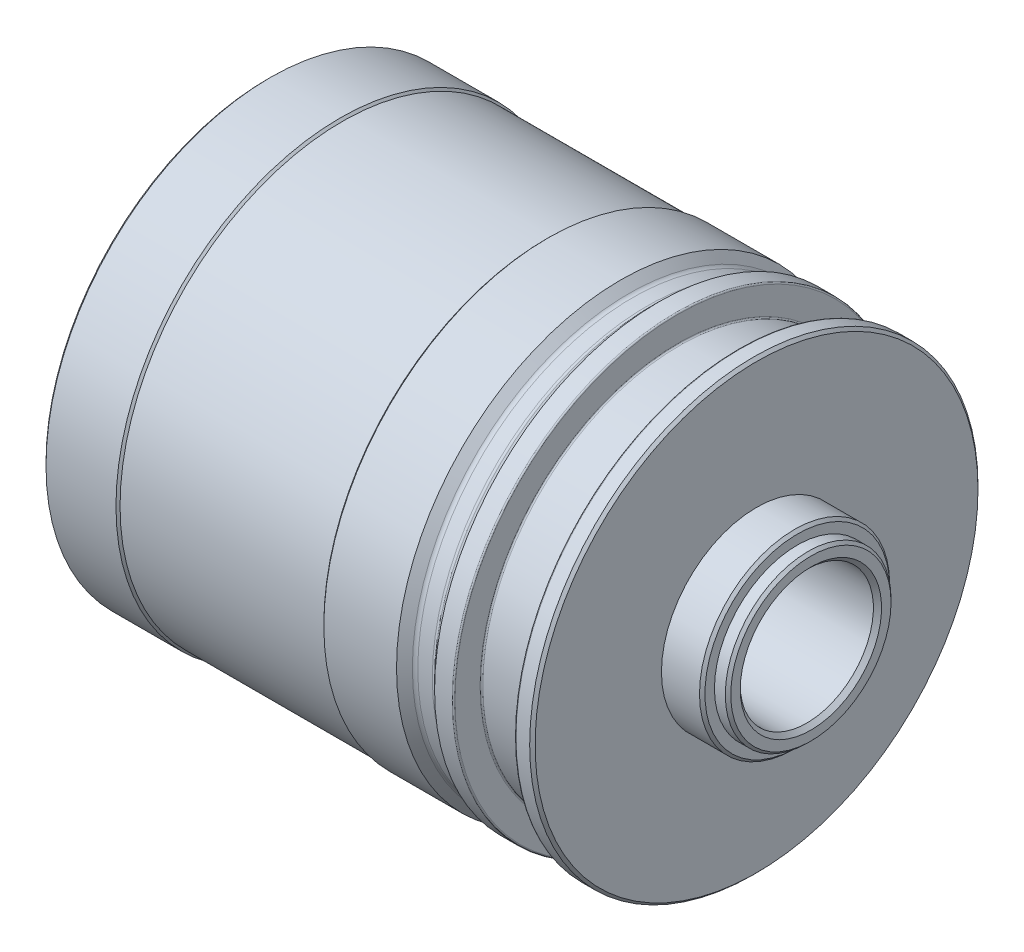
ISO-10303-21;
HEADER;
FILE_DESCRIPTION(('STEP AP214'),'2;1');
FILE_NAME('part.step','',(''),(''),'','','');
FILE_SCHEMA(('AUTOMOTIVE_DESIGN { 1 0 10303 214 1 1 1 1 }'));
ENDSEC;
DATA;
#1=APPLICATION_CONTEXT('core data for automotive mechanical design processes');
#2=APPLICATION_PROTOCOL_DEFINITION('international standard','automotive_design',2000,#1);
#3=PRODUCT_CONTEXT('',#1,'mechanical');
#4=PRODUCT('Part','Part','',(#3));
#5=PRODUCT_RELATED_PRODUCT_CATEGORY('part','',(#4));
#6=PRODUCT_DEFINITION_FORMATION('','',#4);
#7=PRODUCT_DEFINITION_CONTEXT('part definition',#1,'design');
#8=PRODUCT_DEFINITION('design','',#6,#7);
#9=PRODUCT_DEFINITION_SHAPE('','',#8);
#10=(LENGTH_UNIT() NAMED_UNIT(*) SI_UNIT(.MILLI.,.METRE.));
#11=(NAMED_UNIT(*) PLANE_ANGLE_UNIT() SI_UNIT($,.RADIAN.));
#12=(NAMED_UNIT(*) SI_UNIT($,.STERADIAN.) SOLID_ANGLE_UNIT());
#13=UNCERTAINTY_MEASURE_WITH_UNIT(LENGTH_MEASURE(1.E-05),#10,'distance_accuracy_value','');
#14=(GEOMETRIC_REPRESENTATION_CONTEXT(3) GLOBAL_UNCERTAINTY_ASSIGNED_CONTEXT((#13)) GLOBAL_UNIT_ASSIGNED_CONTEXT((#10,
#11,#12)) REPRESENTATION_CONTEXT('',''));
#15=CARTESIAN_POINT('',(0.,0.,0.));
#16=DIRECTION('',(0.,0.,1.));
#17=DIRECTION('',(1.,0.,0.));
#18=AXIS2_PLACEMENT_3D('',#15,#16,#17);
#19=CARTESIAN_POINT('',(8.00000000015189,0.,0.));
#20=DIRECTION('',(-1.,0.,0.));
#21=DIRECTION('',(0.,0.,1.));
#22=AXIS2_PLACEMENT_3D('',#19,#20,#21);
#23=CYLINDRICAL_SURFACE('',#22,16.5);
#24=CARTESIAN_POINT('',(-14.,0.,0.));
#25=DIRECTION('',(-1.,0.,0.));
#26=DIRECTION('',(0.,0.,1.));
#27=AXIS2_PLACEMENT_3D('',#24,#25,#26);
#28=CIRCLE('',#27,16.5);
#29=CARTESIAN_POINT('',(-14.,0.,16.5));
#30=VERTEX_POINT('',#29);
#31=EDGE_CURVE('E133',#30,#30,#28,.T.);
#32=ORIENTED_EDGE('',*,*,#31,.T.);
#33=EDGE_LOOP('',(#32));
#34=FACE_BOUND('',#33,.T.);
#35=CARTESIAN_POINT('',(-19.35,0.,0.));
#36=DIRECTION('',(-1.,0.,0.));
#37=DIRECTION('',(0.,0.,1.));
#38=AXIS2_PLACEMENT_3D('',#35,#36,#37);
#39=CIRCLE('',#38,16.5);
#40=CARTESIAN_POINT('',(-19.35,0.,16.5));
#41=VERTEX_POINT('',#40);
#42=EDGE_CURVE('E136',#41,#41,#39,.T.);
#43=ORIENTED_EDGE('',*,*,#42,.F.);
#44=EDGE_LOOP('',(#43));
#45=FACE_BOUND('',#44,.T.);
#46=ADVANCED_FACE('F29',(#34,#45),#23,.T.);
#47=CARTESIAN_POINT('',(-39.8,0.,0.));
#48=DIRECTION('',(-1.,0.,0.));
#49=DIRECTION('',(0.,0.,1.));
#50=AXIS2_PLACEMENT_3D('',#47,#48,#49);
#51=CIRCLE('',#50,16.5);
#52=CARTESIAN_POINT('',(-39.8,0.,16.5));
#53=VERTEX_POINT('',#52);
#54=EDGE_CURVE('E73',#53,#53,#51,.F.);
#55=ORIENTED_EDGE('',*,*,#54,.T.);
#56=EDGE_LOOP('',(#55));
#57=FACE_BOUND('',#56,.T.);
#58=CARTESIAN_POINT('',(-34.65,0.,0.));
#59=DIRECTION('',(-1.,0.,0.));
#60=DIRECTION('',(0.,0.,1.));
#61=AXIS2_PLACEMENT_3D('',#58,#59,#60);
#62=CIRCLE('',#61,16.5);
#63=CARTESIAN_POINT('',(-34.65,0.,16.5));
#64=VERTEX_POINT('',#63);
#65=EDGE_CURVE('E145',#64,#64,#62,.T.);
#66=ORIENTED_EDGE('',*,*,#65,.T.);
#67=EDGE_LOOP('',(#66));
#68=FACE_BOUND('',#67,.T.);
#69=ADVANCED_FACE('F149',(#57,#68),#23,.T.);
#70=CARTESIAN_POINT('',(-9.89999999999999,0.,0.));
#71=DIRECTION('',(1.,0.,0.));
#72=DIRECTION('',(0.,0.,-1.));
#73=AXIS2_PLACEMENT_3D('',#70,#71,#72);
#74=CIRCLE('',#73,16.5);
#75=CARTESIAN_POINT('',(-9.89999999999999,0.,-16.5));
#76=VERTEX_POINT('',#75);
#77=EDGE_CURVE('E52',#76,#76,#74,.F.);
#78=ORIENTED_EDGE('',*,*,#77,.T.);
#79=EDGE_LOOP('',(#78));
#80=FACE_BOUND('',#79,.T.);
#81=CARTESIAN_POINT('',(-11.2,0.,0.));
#82=DIRECTION('',(-1.,0.,0.));
#83=DIRECTION('',(0.,0.,1.));
#84=AXIS2_PLACEMENT_3D('',#81,#82,#83);
#85=CIRCLE('',#84,16.5);
#86=CARTESIAN_POINT('',(-11.2,0.,16.5));
#87=VERTEX_POINT('',#86);
#88=EDGE_CURVE('E130',#87,#87,#85,.T.);
#89=ORIENTED_EDGE('',*,*,#88,.F.);
#90=EDGE_LOOP('',(#89));
#91=FACE_BOUND('',#90,.T.);
#92=ADVANCED_FACE('F165',(#80,#91),#23,.T.);
#93=CARTESIAN_POINT('',(-21.3,4.,0.));
#94=DIRECTION('',(-1.,0.,0.));
#95=DIRECTION('',(0.,0.,1.));
#96=AXIS2_PLACEMENT_3D('',#93,#94,#95);
#97=PLANE('',#96);
#98=CARTESIAN_POINT('',(-21.3,0.,0.));
#99=DIRECTION('',(-1.,0.,0.));
#100=DIRECTION('',(0.,0.,1.));
#101=AXIS2_PLACEMENT_3D('',#98,#99,#100);
#102=CIRCLE('',#101,4.2);
#103=CARTESIAN_POINT('',(-21.3,0.,4.2));
#104=VERTEX_POINT('',#103);
#105=EDGE_CURVE('E85',#104,#104,#102,.F.);
#106=ORIENTED_EDGE('',*,*,#105,.T.);
#107=EDGE_LOOP('',(#106));
#108=FACE_BOUND('',#107,.T.);
#109=CARTESIAN_POINT('',(-21.3,0.,0.));
#110=DIRECTION('',(-1.,0.,0.));
#111=DIRECTION('',(0.,0.,1.));
#112=AXIS2_PLACEMENT_3D('',#109,#110,#111);
#113=CIRCLE('',#112,15.);
#114=CARTESIAN_POINT('',(-21.3,0.,15.));
#115=VERTEX_POINT('',#114);
#116=EDGE_CURVE('E127',#115,#115,#113,.T.);
#117=ORIENTED_EDGE('',*,*,#116,.T.);
#118=EDGE_LOOP('',(#117));
#119=FACE_BOUND('',#118,.T.);
#120=ADVANCED_FACE('F174',(#108,#119),#97,.T.);
#121=CARTESIAN_POINT('',(8.00000000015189,0.,0.));
#122=DIRECTION('',(-1.,0.,0.));
#123=DIRECTION('',(0.,0.,1.));
#124=AXIS2_PLACEMENT_3D('',#121,#122,#123);
#125=CYLINDRICAL_SURFACE('',#124,4.);
#126=CARTESIAN_POINT('',(-21.1,0.,0.));
#127=DIRECTION('',(-1.,0.,0.));
#128=DIRECTION('',(0.,0.,1.));
#129=AXIS2_PLACEMENT_3D('',#126,#127,#128);
#130=CIRCLE('',#129,4.);
#131=CARTESIAN_POINT('',(-21.1,0.,4.));
#132=VERTEX_POINT('',#131);
#133=EDGE_CURVE('E88',#132,#132,#130,.T.);
#134=ORIENTED_EDGE('',*,*,#133,.T.);
#135=EDGE_LOOP('',(#134));
#136=FACE_BOUND('',#135,.T.);
#137=CARTESIAN_POINT('',(-11.3,0.,0.));
#138=DIRECTION('',(-1.,0.,0.));
#139=DIRECTION('',(0.,0.,1.));
#140=AXIS2_PLACEMENT_3D('',#137,#138,#139);
#141=CIRCLE('',#140,4.);
#142=CARTESIAN_POINT('',(-11.3,0.,4.));
#143=VERTEX_POINT('',#142);
#144=EDGE_CURVE('E97',#143,#143,#141,.T.);
#145=ORIENTED_EDGE('',*,*,#144,.F.);
#146=EDGE_LOOP('',(#145));
#147=FACE_BOUND('',#146,.T.);
#148=ADVANCED_FACE('F179',(#136,#147),#125,.F.);
#149=CARTESIAN_POINT('',(-11.3,4.9,0.));
#150=DIRECTION('',(1.,0.,0.));
#151=DIRECTION('',(0.,0.,-1.));
#152=AXIS2_PLACEMENT_3D('',#149,#150,#151);
#153=PLANE('',#152);
#154=ORIENTED_EDGE('',*,*,#144,.T.);
#155=EDGE_LOOP('',(#154));
#156=FACE_BOUND('',#155,.T.);
#157=CARTESIAN_POINT('',(-11.3,0.,0.));
#158=DIRECTION('',(-1.,0.,0.));
#159=DIRECTION('',(0.,0.,1.));
#160=AXIS2_PLACEMENT_3D('',#157,#158,#159);
#161=CIRCLE('',#160,4.9);
#162=CARTESIAN_POINT('',(-11.3,0.,4.9));
#163=VERTEX_POINT('',#162);
#164=EDGE_CURVE('E100',#163,#163,#161,.T.);
#165=ORIENTED_EDGE('',*,*,#164,.F.);
#166=EDGE_LOOP('',(#165));
#167=FACE_BOUND('',#166,.T.);
#168=ADVANCED_FACE('F310',(#156,#167),#153,.T.);
#169=CARTESIAN_POINT('',(8.00000000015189,0.,0.));
#170=DIRECTION('',(-1.,0.,0.));
#171=DIRECTION('',(0.,0.,1.));
#172=AXIS2_PLACEMENT_3D('',#169,#170,#171);
#173=CYLINDRICAL_SURFACE('',#172,4.9);
#174=ORIENTED_EDGE('',*,*,#164,.T.);
#175=EDGE_LOOP('',(#174));
#176=FACE_BOUND('',#175,.T.);
#177=CARTESIAN_POINT('',(-0.3,0.,0.));
#178=DIRECTION('',(-1.,0.,0.));
#179=DIRECTION('',(0.,0.,1.));
#180=AXIS2_PLACEMENT_3D('',#177,#178,#179);
#181=CIRCLE('',#180,4.9);
#182=CARTESIAN_POINT('',(-0.3,0.,4.9));
#183=VERTEX_POINT('',#182);
#184=EDGE_CURVE('E103',#183,#183,#181,.T.);
#185=ORIENTED_EDGE('',*,*,#184,.F.);
#186=EDGE_LOOP('',(#185));
#187=FACE_BOUND('',#186,.T.);
#188=ADVANCED_FACE('F306',(#176,#187),#173,.F.);
#189=CARTESIAN_POINT('',(0.,0.,0.));
#190=DIRECTION('',(1.,0.,0.));
#191=DIRECTION('',(0.,0.,-1.));
#192=AXIS2_PLACEMENT_3D('',#189,#190,#191);
#193=CONICAL_SURFACE('',#192,5.20000000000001,0.785398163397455);
#194=ORIENTED_EDGE('',*,*,#184,.T.);
#195=EDGE_LOOP('',(#194));
#196=FACE_BOUND('',#195,.T.);
#197=CARTESIAN_POINT('',(0.,0.,0.));
#198=DIRECTION('',(-1.,0.,0.));
#199=DIRECTION('',(0.,0.,1.));
#200=AXIS2_PLACEMENT_3D('',#197,#198,#199);
#201=CIRCLE('',#200,5.20000000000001);
#202=CARTESIAN_POINT('',(0.,0.,5.20000000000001));
#203=VERTEX_POINT('',#202);
#204=EDGE_CURVE('E106',#203,#203,#201,.T.);
#205=ORIENTED_EDGE('',*,*,#204,.F.);
#206=EDGE_LOOP('',(#205));
#207=FACE_BOUND('',#206,.T.);
#208=ADVANCED_FACE('F302',(#196,#207),#193,.F.);
#209=CARTESIAN_POINT('',(0.,6.1,0.));
#210=DIRECTION('',(1.,0.,0.));
#211=DIRECTION('',(0.,0.,-1.));
#212=AXIS2_PLACEMENT_3D('',#209,#210,#211);
#213=PLANE('',#212);
#214=CARTESIAN_POINT('',(0.,0.,0.));
#215=DIRECTION('',(1.,0.,0.));
#216=DIRECTION('',(0.,0.,-1.));
#217=AXIS2_PLACEMENT_3D('',#214,#215,#216);
#218=CIRCLE('',#217,5.9);
#219=CARTESIAN_POINT('',(0.,0.,-5.9));
#220=VERTEX_POINT('',#219);
#221=EDGE_CURVE('E91',#220,#220,#218,.T.);
#222=ORIENTED_EDGE('',*,*,#221,.T.);
#223=EDGE_LOOP('',(#222));
#224=FACE_BOUND('',#223,.T.);
#225=ORIENTED_EDGE('',*,*,#204,.T.);
#226=EDGE_LOOP('',(#225));
#227=FACE_BOUND('',#226,.T.);
#228=ADVANCED_FACE('F298',(#224,#227),#213,.T.);
#229=CARTESIAN_POINT('',(8.00000000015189,0.,0.));
#230=DIRECTION('',(-1.,0.,0.));
#231=DIRECTION('',(0.,0.,1.));
#232=AXIS2_PLACEMENT_3D('',#229,#230,#231);
#233=CYLINDRICAL_SURFACE('',#232,6.1);
#234=CARTESIAN_POINT('',(-0.200000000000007,0.,0.));
#235=DIRECTION('',(1.,0.,0.));
#236=DIRECTION('',(0.,0.,-1.));
#237=AXIS2_PLACEMENT_3D('',#234,#235,#236);
#238=CIRCLE('',#237,6.1);
#239=CARTESIAN_POINT('',(-0.200000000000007,0.,-6.1));
#240=VERTEX_POINT('',#239);
#241=EDGE_CURVE('E94',#240,#240,#238,.F.);
#242=ORIENTED_EDGE('',*,*,#241,.T.);
#243=EDGE_LOOP('',(#242));
#244=FACE_BOUND('',#243,.T.);
#245=CARTESIAN_POINT('',(-0.999999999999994,0.,0.));
#246=DIRECTION('',(-1.,0.,0.));
#247=DIRECTION('',(0.,0.,1.));
#248=AXIS2_PLACEMENT_3D('',#245,#246,#247);
#249=CIRCLE('',#248,6.1);
#250=CARTESIAN_POINT('',(-0.999999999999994,0.,6.1));
#251=VERTEX_POINT('',#250);
#252=EDGE_CURVE('E109',#251,#251,#249,.T.);
#253=ORIENTED_EDGE('',*,*,#252,.F.);
#254=EDGE_LOOP('',(#253));
#255=FACE_BOUND('',#254,.T.);
#256=ADVANCED_FACE('F294',(#244,#255),#233,.T.);
#257=CARTESIAN_POINT('',(-0.999999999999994,7.,0.));
#258=DIRECTION('',(1.,0.,0.));
#259=DIRECTION('',(0.,0.,-1.));
#260=AXIS2_PLACEMENT_3D('',#257,#258,#259);
#261=PLANE('',#260);
#262=CARTESIAN_POINT('',(-0.999999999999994,0.,0.));
#263=DIRECTION('',(1.,0.,0.));
#264=DIRECTION('',(0.,0.,-1.));
#265=AXIS2_PLACEMENT_3D('',#262,#263,#264);
#266=CIRCLE('',#265,6.8);
#267=CARTESIAN_POINT('',(-0.999999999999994,0.,-6.8));
#268=VERTEX_POINT('',#267);
#269=EDGE_CURVE('E67',#268,#268,#266,.T.);
#270=ORIENTED_EDGE('',*,*,#269,.T.);
#271=EDGE_LOOP('',(#270));
#272=FACE_BOUND('',#271,.T.);
#273=ORIENTED_EDGE('',*,*,#252,.T.);
#274=EDGE_LOOP('',(#273));
#275=FACE_BOUND('',#274,.T.);
#276=ADVANCED_FACE('F290',(#272,#275),#261,.T.);
#277=CARTESIAN_POINT('',(8.00000000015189,0.,0.));
#278=DIRECTION('',(-1.,0.,0.));
#279=DIRECTION('',(0.,0.,1.));
#280=AXIS2_PLACEMENT_3D('',#277,#278,#279);
#281=CYLINDRICAL_SURFACE('',#280,7.);
#282=CARTESIAN_POINT('',(-1.2,0.,0.));
#283=DIRECTION('',(1.,0.,0.));
#284=DIRECTION('',(0.,0.,-1.));
#285=AXIS2_PLACEMENT_3D('',#282,#283,#284);
#286=CIRCLE('',#285,7.);
#287=CARTESIAN_POINT('',(-1.2,0.,-7.));
#288=VERTEX_POINT('',#287);
#289=EDGE_CURVE('E70',#288,#288,#286,.F.);
#290=ORIENTED_EDGE('',*,*,#289,.T.);
#291=EDGE_LOOP('',(#290));
#292=FACE_BOUND('',#291,.T.);
#293=CARTESIAN_POINT('',(-4.,0.,0.));
#294=DIRECTION('',(-1.,0.,0.));
#295=DIRECTION('',(0.,0.,1.));
#296=AXIS2_PLACEMENT_3D('',#293,#294,#295);
#297=CIRCLE('',#296,7.);
#298=CARTESIAN_POINT('',(-4.,0.,7.));
#299=VERTEX_POINT('',#298);
#300=EDGE_CURVE('E112',#299,#299,#297,.T.);
#301=ORIENTED_EDGE('',*,*,#300,.F.);
#302=EDGE_LOOP('',(#301));
#303=FACE_BOUND('',#302,.T.);
#304=ADVANCED_FACE('F287',(#292,#303),#281,.T.);
#305=CARTESIAN_POINT('',(-3.99999999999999,16.5,0.));
#306=DIRECTION('',(1.,0.,0.));
#307=DIRECTION('',(0.,0.,-1.));
#308=AXIS2_PLACEMENT_3D('',#305,#306,#307);
#309=PLANE('',#308);
#310=CARTESIAN_POINT('',(-3.99999999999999,0.,0.));
#311=DIRECTION('',(1.,0.,0.));
#312=DIRECTION('',(0.,0.,-1.));
#313=AXIS2_PLACEMENT_3D('',#310,#311,#312);
#314=CIRCLE('',#313,16.3);
#315=CARTESIAN_POINT('',(-3.99999999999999,0.,-16.3));
#316=VERTEX_POINT('',#315);
#317=EDGE_CURVE('E10',#316,#316,#314,.T.);
#318=ORIENTED_EDGE('',*,*,#317,.T.);
#319=EDGE_LOOP('',(#318));
#320=FACE_BOUND('',#319,.T.);
#321=ORIENTED_EDGE('',*,*,#300,.T.);
#322=EDGE_LOOP('',(#321));
#323=FACE_BOUND('',#322,.T.);
#324=ADVANCED_FACE('F284',(#320,#323),#309,.T.);
#325=CARTESIAN_POINT('',(8.00000000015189,0.,0.));
#326=DIRECTION('',(-1.,0.,0.));
#327=DIRECTION('',(0.,0.,1.));
#328=AXIS2_PLACEMENT_3D('',#325,#326,#327);
#329=CYLINDRICAL_SURFACE('',#328,16.5);
#330=CARTESIAN_POINT('',(-4.19999999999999,0.,0.));
#331=DIRECTION('',(1.,0.,0.));
#332=DIRECTION('',(0.,0.,-1.));
#333=AXIS2_PLACEMENT_3D('',#330,#331,#332);
#334=CIRCLE('',#333,16.5);
#335=CARTESIAN_POINT('',(-4.19999999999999,0.,-16.5));
#336=VERTEX_POINT('',#335);
#337=EDGE_CURVE('E36',#336,#336,#334,.F.);
#338=ORIENTED_EDGE('',*,*,#337,.T.);
#339=EDGE_LOOP('',(#338));
#340=FACE_BOUND('',#339,.T.);
#341=CARTESIAN_POINT('',(-5.19999999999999,0.,0.));
#342=DIRECTION('',(-1.,0.,0.));
#343=DIRECTION('',(0.,0.,1.));
#344=AXIS2_PLACEMENT_3D('',#341,#342,#343);
#345=CIRCLE('',#344,16.5);
#346=CARTESIAN_POINT('',(-5.19999999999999,0.,16.5));
#347=VERTEX_POINT('',#346);
#348=EDGE_CURVE('E40',#347,#347,#345,.F.);
#349=ORIENTED_EDGE('',*,*,#348,.T.);
#350=EDGE_LOOP('',(#349));
#351=FACE_BOUND('',#350,.T.);
#352=ADVANCED_FACE('F259',(#340,#351),#329,.T.);
#353=CARTESIAN_POINT('',(-5.29999999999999,14.85,0.));
#354=DIRECTION('',(-1.,0.,0.));
#355=DIRECTION('',(0.,0.,1.));
#356=AXIS2_PLACEMENT_3D('',#353,#354,#355);
#357=PLANE('',#356);
#358=CARTESIAN_POINT('',(-5.29999999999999,0.,0.));
#359=DIRECTION('',(-1.,0.,0.));
#360=DIRECTION('',(0.,0.,1.));
#361=AXIS2_PLACEMENT_3D('',#358,#359,#360);
#362=CIRCLE('',#361,16.4);
#363=CARTESIAN_POINT('',(-5.29999999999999,0.,16.4));
#364=VERTEX_POINT('',#363);
#365=EDGE_CURVE('E44',#364,#364,#362,.T.);
#366=ORIENTED_EDGE('',*,*,#365,.T.);
#367=EDGE_LOOP('',(#366));
#368=FACE_BOUND('',#367,.T.);
#369=CARTESIAN_POINT('',(-5.3,0.,0.));
#370=DIRECTION('',(-1.,0.,0.));
#371=DIRECTION('',(0.,0.,1.));
#372=AXIS2_PLACEMENT_3D('',#369,#370,#371);
#373=CIRCLE('',#372,14.85);
#374=CARTESIAN_POINT('',(-5.3,0.,14.85));
#375=VERTEX_POINT('',#374);
#376=EDGE_CURVE('E115',#375,#375,#373,.T.);
#377=ORIENTED_EDGE('',*,*,#376,.F.);
#378=EDGE_LOOP('',(#377));
#379=FACE_BOUND('',#378,.T.);
#380=ADVANCED_FACE('F255',(#368,#379),#357,.T.);
#381=CARTESIAN_POINT('',(-5.69999999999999,0.,0.));
#382=DIRECTION('',(-1.,0.,0.));
#383=DIRECTION('',(0.,0.,1.));
#384=AXIS2_PLACEMENT_3D('',#381,#382,#383);
#385=TOROIDAL_SURFACE('',#384,14.85,0.399999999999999);
#386=ORIENTED_EDGE('',*,*,#376,.T.);
#387=EDGE_LOOP('',(#386));
#388=FACE_BOUND('',#387,.T.);
#389=CARTESIAN_POINT('',(-5.69999999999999,0.,0.));
#390=DIRECTION('',(-1.,0.,0.));
#391=DIRECTION('',(0.,0.,1.));
#392=AXIS2_PLACEMENT_3D('',#389,#390,#391);
#393=CIRCLE('',#392,14.45);
#394=CARTESIAN_POINT('',(-5.69999999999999,0.,14.45));
#395=VERTEX_POINT('',#394);
#396=EDGE_CURVE('E118',#395,#395,#393,.T.);
#397=ORIENTED_EDGE('',*,*,#396,.F.);
#398=EDGE_LOOP('',(#397));
#399=FACE_BOUND('',#398,.T.);
#400=ADVANCED_FACE('F258',(#388,#399),#385,.F.);
#401=CARTESIAN_POINT('',(8.00000000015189,0.,0.));
#402=DIRECTION('',(-1.,0.,0.));
#403=DIRECTION('',(0.,0.,1.));
#404=AXIS2_PLACEMENT_3D('',#401,#402,#403);
#405=CYLINDRICAL_SURFACE('',#404,14.45);
#406=ORIENTED_EDGE('',*,*,#396,.T.);
#407=EDGE_LOOP('',(#406));
#408=FACE_BOUND('',#407,.T.);
#409=CARTESIAN_POINT('',(-9.69999999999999,0.,0.));
#410=DIRECTION('',(-1.,0.,0.));
#411=DIRECTION('',(0.,0.,1.));
#412=AXIS2_PLACEMENT_3D('',#409,#410,#411);
#413=CIRCLE('',#412,14.45);
#414=CARTESIAN_POINT('',(-9.69999999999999,0.,14.45));
#415=VERTEX_POINT('',#414);
#416=EDGE_CURVE('E121',#415,#415,#413,.T.);
#417=ORIENTED_EDGE('',*,*,#416,.F.);
#418=EDGE_LOOP('',(#417));
#419=FACE_BOUND('',#418,.T.);
#420=ADVANCED_FACE('F265',(#408,#419),#405,.T.);
#421=CARTESIAN_POINT('',(-9.69999999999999,0.,0.));
#422=DIRECTION('',(-1.,0.,0.));
#423=DIRECTION('',(0.,0.,1.));
#424=AXIS2_PLACEMENT_3D('',#421,#422,#423);
#425=TOROIDAL_SURFACE('',#424,14.55,0.0999999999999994);
#426=ORIENTED_EDGE('',*,*,#416,.T.);
#427=EDGE_LOOP('',(#426));
#428=FACE_BOUND('',#427,.T.);
#429=CARTESIAN_POINT('',(-9.79999999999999,0.,0.));
#430=DIRECTION('',(-1.,0.,0.));
#431=DIRECTION('',(0.,0.,1.));
#432=AXIS2_PLACEMENT_3D('',#429,#430,#431);
#433=CIRCLE('',#432,14.55);
#434=CARTESIAN_POINT('',(-9.79999999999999,0.,14.55));
#435=VERTEX_POINT('',#434);
#436=EDGE_CURVE('E124',#435,#435,#433,.T.);
#437=ORIENTED_EDGE('',*,*,#436,.F.);
#438=EDGE_LOOP('',(#437));
#439=FACE_BOUND('',#438,.T.);
#440=ADVANCED_FACE('F209',(#428,#439),#425,.F.);
#441=CARTESIAN_POINT('',(-9.79999999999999,16.5,0.));
#442=DIRECTION('',(1.,0.,0.));
#443=DIRECTION('',(0.,0.,-1.));
#444=AXIS2_PLACEMENT_3D('',#441,#442,#443);
#445=PLANE('',#444);
#446=CARTESIAN_POINT('',(-9.79999999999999,0.,0.));
#447=DIRECTION('',(1.,0.,0.));
#448=DIRECTION('',(0.,0.,-1.));
#449=AXIS2_PLACEMENT_3D('',#446,#447,#448);
#450=CIRCLE('',#449,16.4);
#451=CARTESIAN_POINT('',(-9.79999999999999,0.,-16.4));
#452=VERTEX_POINT('',#451);
#453=EDGE_CURVE('E49',#452,#452,#450,.T.);
#454=ORIENTED_EDGE('',*,*,#453,.T.);
#455=EDGE_LOOP('',(#454));
#456=FACE_BOUND('',#455,.T.);
#457=ORIENTED_EDGE('',*,*,#436,.T.);
#458=EDGE_LOOP('',(#457));
#459=FACE_BOUND('',#458,.T.);
#460=ADVANCED_FACE('F204',(#456,#459),#445,.T.);
#461=CARTESIAN_POINT('',(-40.,15.,0.));
#462=DIRECTION('',(-1.,0.,0.));
#463=DIRECTION('',(0.,0.,1.));
#464=AXIS2_PLACEMENT_3D('',#461,#462,#463);
#465=PLANE('',#464);
#466=CARTESIAN_POINT('',(-40.,0.,0.));
#467=DIRECTION('',(-1.,0.,0.));
#468=DIRECTION('',(0.,0.,1.));
#469=AXIS2_PLACEMENT_3D('',#466,#467,#468);
#470=CIRCLE('',#469,15.2);
#471=CARTESIAN_POINT('',(-40.,0.,15.2));
#472=VERTEX_POINT('',#471);
#473=EDGE_CURVE('E76',#472,#472,#470,.F.);
#474=ORIENTED_EDGE('',*,*,#473,.T.);
#475=EDGE_LOOP('',(#474));
#476=FACE_BOUND('',#475,.T.);
#477=CARTESIAN_POINT('',(-40.,0.,0.));
#478=DIRECTION('',(-1.,0.,0.));
#479=DIRECTION('',(0.,0.,1.));
#480=AXIS2_PLACEMENT_3D('',#477,#478,#479);
#481=CIRCLE('',#480,16.3);
#482=CARTESIAN_POINT('',(-40.,0.,16.3));
#483=VERTEX_POINT('',#482);
#484=EDGE_CURVE('E79',#483,#483,#481,.T.);
#485=ORIENTED_EDGE('',*,*,#484,.T.);
#486=EDGE_LOOP('',(#485));
#487=FACE_BOUND('',#486,.T.);
#488=ADVANCED_FACE('F199',(#476,#487),#465,.T.);
#489=CARTESIAN_POINT('',(8.00000000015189,0.,0.));
#490=DIRECTION('',(-1.,0.,0.));
#491=DIRECTION('',(0.,0.,1.));
#492=AXIS2_PLACEMENT_3D('',#489,#490,#491);
#493=CYLINDRICAL_SURFACE('',#492,15.);
#494=CARTESIAN_POINT('',(-39.8,0.,0.));
#495=DIRECTION('',(-1.,0.,0.));
#496=DIRECTION('',(0.,0.,1.));
#497=AXIS2_PLACEMENT_3D('',#494,#495,#496);
#498=CIRCLE('',#497,15.);
#499=CARTESIAN_POINT('',(-39.8,0.,15.));
#500=VERTEX_POINT('',#499);
#501=EDGE_CURVE('E82',#500,#500,#498,.T.);
#502=ORIENTED_EDGE('',*,*,#501,.T.);
#503=EDGE_LOOP('',(#502));
#504=FACE_BOUND('',#503,.T.);
#505=ORIENTED_EDGE('',*,*,#116,.F.);
#506=EDGE_LOOP('',(#505));
#507=FACE_BOUND('',#506,.T.);
#508=ADVANCED_FACE('F189',(#504,#507),#493,.F.);
#509=CARTESIAN_POINT('',(-11.9,0.,0.));
#510=DIRECTION('',(1.,0.,0.));
#511=DIRECTION('',(0.,0.,-1.));
#512=AXIS2_PLACEMENT_3D('',#509,#510,#511);
#513=CONICAL_SURFACE('',#512,15.8,0.785398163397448);
#514=CARTESIAN_POINT('',(-11.7828427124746,0.,0.));
#515=DIRECTION('',(1.,0.,0.));
#516=DIRECTION('',(0.,0.,-1.));
#517=AXIS2_PLACEMENT_3D('',#514,#515,#516);
#518=CIRCLE('',#517,15.9171572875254);
#519=CARTESIAN_POINT('',(-11.7828427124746,0.,-15.9171572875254));
#520=VERTEX_POINT('',#519);
#521=EDGE_CURVE('E55',#520,#520,#518,.T.);
#522=ORIENTED_EDGE('',*,*,#521,.T.);
#523=EDGE_LOOP('',(#522));
#524=FACE_BOUND('',#523,.T.);
#525=ORIENTED_EDGE('',*,*,#88,.T.);
#526=EDGE_LOOP('',(#525));
#527=FACE_BOUND('',#526,.T.);
#528=ADVANCED_FACE('F186',(#524,#527),#513,.T.);
#529=CARTESIAN_POINT('',(8.00000000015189,0.,0.));
#530=DIRECTION('',(-1.,0.,0.));
#531=DIRECTION('',(0.,0.,1.));
#532=AXIS2_PLACEMENT_3D('',#529,#530,#531);
#533=CYLINDRICAL_SURFACE('',#532,15.8);
#534=CARTESIAN_POINT('',(-13.1343145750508,0.,0.));
#535=DIRECTION('',(-1.,0.,0.));
#536=DIRECTION('',(0.,0.,1.));
#537=AXIS2_PLACEMENT_3D('',#534,#535,#536);
#538=CIRCLE('',#537,15.8);
#539=CARTESIAN_POINT('',(-13.1343145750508,0.,15.8));
#540=VERTEX_POINT('',#539);
#541=EDGE_CURVE('E58',#540,#540,#538,.F.);
#542=ORIENTED_EDGE('',*,*,#541,.T.);
#543=EDGE_LOOP('',(#542));
#544=FACE_BOUND('',#543,.T.);
#545=CARTESIAN_POINT('',(-12.0656854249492,0.,0.));
#546=DIRECTION('',(-1.,0.,0.));
#547=DIRECTION('',(0.,0.,1.));
#548=AXIS2_PLACEMENT_3D('',#545,#546,#547);
#549=CIRCLE('',#548,15.8);
#550=CARTESIAN_POINT('',(-12.0656854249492,0.,15.8));
#551=VERTEX_POINT('',#550);
#552=EDGE_CURVE('E61',#551,#551,#549,.T.);
#553=ORIENTED_EDGE('',*,*,#552,.T.);
#554=EDGE_LOOP('',(#553));
#555=FACE_BOUND('',#554,.T.);
#556=ADVANCED_FACE('F188',(#544,#555),#533,.T.);
#557=CARTESIAN_POINT('',(-14.,0.,0.));
#558=DIRECTION('',(-1.,0.,0.));
#559=DIRECTION('',(0.,0.,1.));
#560=AXIS2_PLACEMENT_3D('',#557,#558,#559);
#561=CONICAL_SURFACE('',#560,16.5,0.785398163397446);
#562=CARTESIAN_POINT('',(-13.4171572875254,0.,0.));
#563=DIRECTION('',(-1.,0.,0.));
#564=DIRECTION('',(0.,0.,1.));
#565=AXIS2_PLACEMENT_3D('',#562,#563,#564);
#566=CIRCLE('',#565,15.9171572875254);
#567=CARTESIAN_POINT('',(-13.4171572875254,0.,15.9171572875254));
#568=VERTEX_POINT('',#567);
#569=EDGE_CURVE('E64',#568,#568,#566,.T.);
#570=ORIENTED_EDGE('',*,*,#569,.T.);
#571=EDGE_LOOP('',(#570));
#572=FACE_BOUND('',#571,.T.);
#573=ORIENTED_EDGE('',*,*,#31,.F.);
#574=EDGE_LOOP('',(#573));
#575=FACE_BOUND('',#574,.T.);
#576=ADVANCED_FACE('F196',(#572,#575),#561,.T.);
#577=CARTESIAN_POINT('',(-0.200000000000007,0.,0.));
#578=DIRECTION('',(-1.,0.,0.));
#579=DIRECTION('',(0.,0.,1.));
#580=AXIS2_PLACEMENT_3D('',#577,#578,#579);
#581=CONICAL_SURFACE('',#580,6.1,0.785398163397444);
#582=ORIENTED_EDGE('',*,*,#221,.F.);
#583=EDGE_LOOP('',(#582));
#584=FACE_BOUND('',#583,.T.);
#585=ORIENTED_EDGE('',*,*,#241,.F.);
#586=EDGE_LOOP('',(#585));
#587=FACE_BOUND('',#586,.T.);
#588=ADVANCED_FACE('F318',(#584,#587),#581,.T.);
#589=CARTESIAN_POINT('',(-21.1,0.,0.));
#590=DIRECTION('',(-1.,0.,0.));
#591=DIRECTION('',(0.,0.,1.));
#592=AXIS2_PLACEMENT_3D('',#589,#590,#591);
#593=CONICAL_SURFACE('',#592,4.,0.785398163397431);
#594=ORIENTED_EDGE('',*,*,#105,.F.);
#595=EDGE_LOOP('',(#594));
#596=FACE_BOUND('',#595,.T.);
#597=ORIENTED_EDGE('',*,*,#133,.F.);
#598=EDGE_LOOP('',(#597));
#599=FACE_BOUND('',#598,.T.);
#600=ADVANCED_FACE('F228',(#596,#599),#593,.F.);
#601=CARTESIAN_POINT('',(-39.8,0.,0.));
#602=DIRECTION('',(-1.,0.,0.));
#603=DIRECTION('',(0.,0.,1.));
#604=AXIS2_PLACEMENT_3D('',#601,#602,#603);
#605=CONICAL_SURFACE('',#604,15.,0.785398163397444);
#606=ORIENTED_EDGE('',*,*,#473,.F.);
#607=EDGE_LOOP('',(#606));
#608=FACE_BOUND('',#607,.T.);
#609=ORIENTED_EDGE('',*,*,#501,.F.);
#610=EDGE_LOOP('',(#609));
#611=FACE_BOUND('',#610,.T.);
#612=ADVANCED_FACE('F218',(#608,#611),#605,.F.);
#613=CARTESIAN_POINT('',(-40.,0.,0.));
#614=DIRECTION('',(1.,0.,0.));
#615=DIRECTION('',(0.,0.,-1.));
#616=AXIS2_PLACEMENT_3D('',#613,#614,#615);
#617=CONICAL_SURFACE('',#616,16.3,0.785398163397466);
#618=ORIENTED_EDGE('',*,*,#54,.F.);
#619=EDGE_LOOP('',(#618));
#620=FACE_BOUND('',#619,.T.);
#621=ORIENTED_EDGE('',*,*,#484,.F.);
#622=EDGE_LOOP('',(#621));
#623=FACE_BOUND('',#622,.T.);
#624=ADVANCED_FACE('F215',(#620,#623),#617,.T.);
#625=CARTESIAN_POINT('',(-1.2,0.,0.));
#626=DIRECTION('',(-1.,0.,0.));
#627=DIRECTION('',(0.,0.,1.));
#628=AXIS2_PLACEMENT_3D('',#625,#626,#627);
#629=CONICAL_SURFACE('',#628,7.,0.785398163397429);
#630=ORIENTED_EDGE('',*,*,#269,.F.);
#631=EDGE_LOOP('',(#630));
#632=FACE_BOUND('',#631,.T.);
#633=ORIENTED_EDGE('',*,*,#289,.F.);
#634=EDGE_LOOP('',(#633));
#635=FACE_BOUND('',#634,.T.);
#636=ADVANCED_FACE('F217',(#632,#635),#629,.T.);
#637=CARTESIAN_POINT('',(-13.1343145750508,0.,0.));
#638=DIRECTION('',(-1.,0.,0.));
#639=DIRECTION('',(0.,0.,1.));
#640=AXIS2_PLACEMENT_3D('',#637,#638,#639);
#641=TOROIDAL_SURFACE('',#640,16.2,0.4);
#642=ORIENTED_EDGE('',*,*,#541,.F.);
#643=EDGE_LOOP('',(#642));
#644=FACE_BOUND('',#643,.T.);
#645=ORIENTED_EDGE('',*,*,#569,.F.);
#646=EDGE_LOOP('',(#645));
#647=FACE_BOUND('',#646,.T.);
#648=ADVANCED_FACE('F225',(#644,#647),#641,.F.);
#649=CARTESIAN_POINT('',(-12.0656854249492,0.,0.));
#650=DIRECTION('',(-1.,0.,0.));
#651=DIRECTION('',(0.,0.,1.));
#652=AXIS2_PLACEMENT_3D('',#649,#650,#651);
#653=TOROIDAL_SURFACE('',#652,16.2,0.4);
#654=ORIENTED_EDGE('',*,*,#521,.F.);
#655=EDGE_LOOP('',(#654));
#656=FACE_BOUND('',#655,.T.);
#657=ORIENTED_EDGE('',*,*,#552,.F.);
#658=EDGE_LOOP('',(#657));
#659=FACE_BOUND('',#658,.T.);
#660=ADVANCED_FACE('F236',(#656,#659),#653,.F.);
#661=CARTESIAN_POINT('',(-9.89999999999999,0.,0.));
#662=DIRECTION('',(1.,0.,0.));
#663=DIRECTION('',(0.,0.,-1.));
#664=AXIS2_PLACEMENT_3D('',#661,#662,#663);
#665=TOROIDAL_SURFACE('',#664,16.4,0.1);
#666=ORIENTED_EDGE('',*,*,#453,.F.);
#667=EDGE_LOOP('',(#666));
#668=FACE_BOUND('',#667,.T.);
#669=ORIENTED_EDGE('',*,*,#77,.F.);
#670=EDGE_LOOP('',(#669));
#671=FACE_BOUND('',#670,.T.);
#672=ADVANCED_FACE('F240',(#668,#671),#665,.T.);
#673=CARTESIAN_POINT('',(-5.19999999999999,0.,0.));
#674=DIRECTION('',(-1.,0.,0.));
#675=DIRECTION('',(0.,0.,1.));
#676=AXIS2_PLACEMENT_3D('',#673,#674,#675);
#677=TOROIDAL_SURFACE('',#676,16.4,0.1);
#678=ORIENTED_EDGE('',*,*,#348,.F.);
#679=EDGE_LOOP('',(#678));
#680=FACE_BOUND('',#679,.T.);
#681=ORIENTED_EDGE('',*,*,#365,.F.);
#682=EDGE_LOOP('',(#681));
#683=FACE_BOUND('',#682,.T.);
#684=ADVANCED_FACE('F243',(#680,#683),#677,.T.);
#685=CARTESIAN_POINT('',(-4.19999999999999,0.,0.));
#686=DIRECTION('',(-1.,0.,0.));
#687=DIRECTION('',(0.,0.,1.));
#688=AXIS2_PLACEMENT_3D('',#685,#686,#687);
#689=CONICAL_SURFACE('',#688,16.5,0.785398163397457);
#690=ORIENTED_EDGE('',*,*,#317,.F.);
#691=EDGE_LOOP('',(#690));
#692=FACE_BOUND('',#691,.T.);
#693=ORIENTED_EDGE('',*,*,#337,.F.);
#694=EDGE_LOOP('',(#693));
#695=FACE_BOUND('',#694,.T.);
#696=ADVANCED_FACE('F31',(#692,#695),#689,.T.);
#697=CARTESIAN_POINT('',(-19.5,0.,0.));
#698=DIRECTION('',(1.,0.,0.));
#699=DIRECTION('',(0.,0.,-1.));
#700=AXIS2_PLACEMENT_3D('',#697,#698,#699);
#701=CONICAL_SURFACE('',#700,16.35,0.785398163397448);
#702=ORIENTED_EDGE('',*,*,#42,.T.);
#703=EDGE_LOOP('',(#702));
#704=FACE_BOUND('',#703,.T.);
#705=CARTESIAN_POINT('',(-19.5,0.,0.));
#706=DIRECTION('',(-1.,0.,0.));
#707=DIRECTION('',(0.,0.,1.));
#708=AXIS2_PLACEMENT_3D('',#705,#706,#707);
#709=CIRCLE('',#708,16.35);
#710=CARTESIAN_POINT('',(-19.5,0.,16.35));
#711=VERTEX_POINT('',#710);
#712=EDGE_CURVE('E139',#711,#711,#709,.T.);
#713=ORIENTED_EDGE('',*,*,#712,.F.);
#714=EDGE_LOOP('',(#713));
#715=FACE_BOUND('',#714,.T.);
#716=ADVANCED_FACE('F159',(#704,#715),#701,.T.);
#717=CARTESIAN_POINT('',(8.00000000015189,0.,0.));
#718=DIRECTION('',(-1.,0.,0.));
#719=DIRECTION('',(0.,0.,1.));
#720=AXIS2_PLACEMENT_3D('',#717,#718,#719);
#721=CYLINDRICAL_SURFACE('',#720,16.35);
#722=ORIENTED_EDGE('',*,*,#712,.T.);
#723=EDGE_LOOP('',(#722));
#724=FACE_BOUND('',#723,.T.);
#725=CARTESIAN_POINT('',(-34.5,0.,0.));
#726=DIRECTION('',(-1.,0.,0.));
#727=DIRECTION('',(0.,0.,1.));
#728=AXIS2_PLACEMENT_3D('',#725,#726,#727);
#729=CIRCLE('',#728,16.35);
#730=CARTESIAN_POINT('',(-34.5,0.,16.35));
#731=VERTEX_POINT('',#730);
#732=EDGE_CURVE('E142',#731,#731,#729,.T.);
#733=ORIENTED_EDGE('',*,*,#732,.F.);
#734=EDGE_LOOP('',(#733));
#735=FACE_BOUND('',#734,.T.);
#736=ADVANCED_FACE('F153',(#724,#735),#721,.T.);
#737=CARTESIAN_POINT('',(-34.65,0.,0.));
#738=DIRECTION('',(-1.,0.,0.));
#739=DIRECTION('',(0.,0.,1.));
#740=AXIS2_PLACEMENT_3D('',#737,#738,#739);
#741=CONICAL_SURFACE('',#740,16.5,0.785398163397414);
#742=ORIENTED_EDGE('',*,*,#732,.T.);
#743=EDGE_LOOP('',(#742));
#744=FACE_BOUND('',#743,.T.);
#745=ORIENTED_EDGE('',*,*,#65,.F.);
#746=EDGE_LOOP('',(#745));
#747=FACE_BOUND('',#746,.T.);
#748=ADVANCED_FACE('F151',(#744,#747),#741,.T.);
#749=CLOSED_SHELL('',(#46,#69,#92,#120,#148,#168,#188,#208,#228,#256,#276,#304,#324,#352,#380,
#400,#420,#440,#460,#488,#508,#528,#556,#576,#588,#600,#612,#624,#636,#648,#660,#672,#684,#696,
#716,#736,#748));
#750=MANIFOLD_SOLID_BREP('B2',#749);
#751=ADVANCED_BREP_SHAPE_REPRESENTATION('',(#18,#750),#14);
#752=SHAPE_DEFINITION_REPRESENTATION(#9,#751);
ENDSEC;
END-ISO-10303-21;
